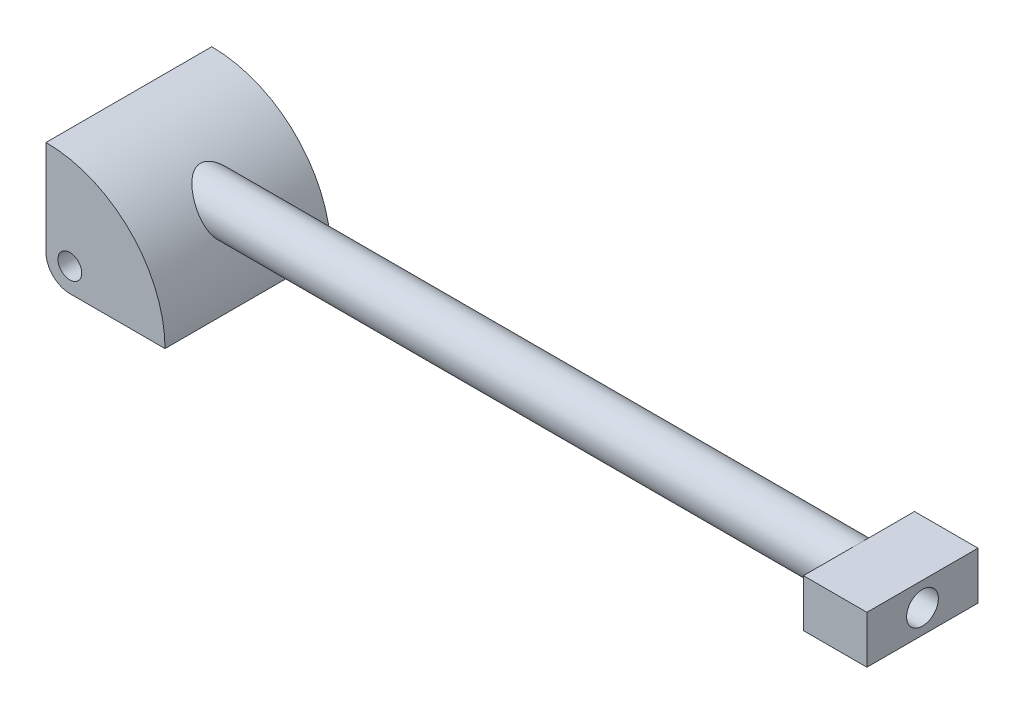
from build123d import *

# Parameters (mm, degrees)
SKETCH1_R           = 9.525
BOSS_EXTRUDE1_DEPTH = 132.6642
SKETCH2_R           = 19.05
BOSS_EXTRUDE2_DEPTH = 635
SKETCH3_W           = 88.9
SKETCH3_H           = 38.1
BOSS_EXTRUDE3_DEPTH = 50.8
SKETCH4_R           = 12.7
CUT_EXTRUDE1_DEPTH  = 624.84


with BuildPart() as part:
    # Sketch1 → Boss-Extrude1 (new body)
    with BuildSketch(Plane.XY):
        with BuildLine():
            Line((-19.05, 0), (-19.05, 76.2))
            ThreePointArc((-19.05, 76.2), (48.301920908, 48.301920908), (76.2, -19.05))
            Line((76.2, -19.05), (0, -19.05))
            ThreePointArc((0, -19.05), (-13.470384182, -13.470384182), (-19.05, 0))
        make_face()
        Circle(SKETCH1_R, mode=Mode.SUBTRACT)
    extrude(amount=-BOSS_EXTRUDE1_DEPTH)

    # Sketch2 → Boss-Extrude2 (add)
    with BuildSketch(Plane.ZY.offset(19.05)):
        with Locations((-66.3321, 38.1)):
            Circle(SKETCH2_R)
    extrude(amount=-BOSS_EXTRUDE2_DEPTH)

    # Sketch3 → Boss-Extrude3 (add)
    with BuildSketch(Plane(origin=(615.95, 0, 0), x_dir=(0, 0, -1), z_dir=(1, 0, 0))):
        with Locations((66.3321, 38.1)):
            Rectangle(SKETCH3_W, SKETCH3_H)
    extrude(amount=-BOSS_EXTRUDE3_DEPTH)

    # Sketch4 → Cut-Extrude1 (cut)
    with BuildSketch(Plane(origin=(615.95, 0, 0), x_dir=(0, 0, -1), z_dir=(1, 0, 0))):
        with Locations((66.3321, 38.1)):
            Circle(SKETCH4_R)
    extrude(amount=-CUT_EXTRUDE1_DEPTH, mode=Mode.SUBTRACT)


solid = part.part
